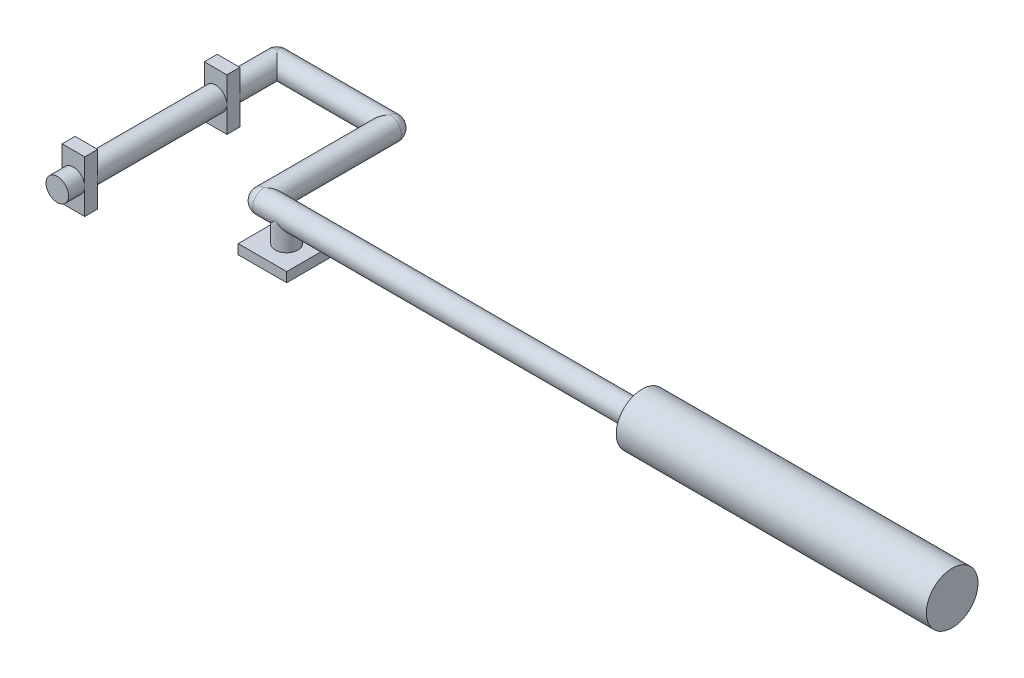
ISO-10303-21;
HEADER;
FILE_DESCRIPTION(('STEP AP214'),'2;1');
FILE_NAME('part.step','',(''),(''),'','','');
FILE_SCHEMA(('AUTOMOTIVE_DESIGN { 1 0 10303 214 1 1 1 1 }'));
ENDSEC;
DATA;
#1=APPLICATION_CONTEXT('core data for automotive mechanical design processes');
#2=APPLICATION_PROTOCOL_DEFINITION('international standard','automotive_design',2000,#1);
#3=PRODUCT_CONTEXT('',#1,'mechanical');
#4=PRODUCT('Part','Part','',(#3));
#5=PRODUCT_RELATED_PRODUCT_CATEGORY('part','',(#4));
#6=PRODUCT_DEFINITION_FORMATION('','',#4);
#7=PRODUCT_DEFINITION_CONTEXT('part definition',#1,'design');
#8=PRODUCT_DEFINITION('design','',#6,#7);
#9=PRODUCT_DEFINITION_SHAPE('','',#8);
#10=(LENGTH_UNIT() NAMED_UNIT(*) SI_UNIT(.MILLI.,.METRE.));
#11=(NAMED_UNIT(*) PLANE_ANGLE_UNIT() SI_UNIT($,.RADIAN.));
#12=(NAMED_UNIT(*) SI_UNIT($,.STERADIAN.) SOLID_ANGLE_UNIT());
#13=UNCERTAINTY_MEASURE_WITH_UNIT(LENGTH_MEASURE(1.E-05),#10,'distance_accuracy_value','');
#14=(GEOMETRIC_REPRESENTATION_CONTEXT(3) GLOBAL_UNCERTAINTY_ASSIGNED_CONTEXT((#13)) GLOBAL_UNIT_ASSIGNED_CONTEXT((#10,
#11,#12)) REPRESENTATION_CONTEXT('',''));
#15=CARTESIAN_POINT('',(0.,0.,0.));
#16=DIRECTION('',(0.,0.,1.));
#17=DIRECTION('',(1.,0.,0.));
#18=AXIS2_PLACEMENT_3D('',#15,#16,#17);
#19=CARTESIAN_POINT('',(23.572307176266,0.,0.));
#20=DIRECTION('',(-1.,0.,0.));
#21=DIRECTION('',(0.,0.,1.));
#22=AXIS2_PLACEMENT_3D('',#19,#20,#21);
#23=CYLINDRICAL_SURFACE('',#22,3.5);
#24=CARTESIAN_POINT('',(35.,0.,0.));
#25=DIRECTION('',(-0.707106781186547,0.,-0.707106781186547));
#26=DIRECTION('',(0.707106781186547,0.,-0.707106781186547));
#27=AXIS2_PLACEMENT_3D('',#24,#25,#26);
#28=ELLIPSE('',#27,4.94974746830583,3.5);
#29=CARTESIAN_POINT('',(35.,3.5,0.));
#30=VERTEX_POINT('',#29);
#31=CARTESIAN_POINT('',(35.,-3.5,0.));
#32=VERTEX_POINT('',#31);
#33=EDGE_CURVE('E222',#30,#32,#28,.T.);
#34=ORIENTED_EDGE('',*,*,#33,.F.);
#35=CARTESIAN_POINT('',(35.,0.,0.));
#36=DIRECTION('',(-1.,0.,0.));
#37=DIRECTION('',(0.,0.,1.));
#38=AXIS2_PLACEMENT_3D('',#35,#36,#37);
#39=CIRCLE('',#38,3.5);
#40=EDGE_CURVE('E219',#32,#30,#39,.T.);
#41=ORIENTED_EDGE('',*,*,#40,.F.);
#42=EDGE_LOOP('',(#34,#41));
#43=FACE_BOUND('',#42,.T.);
#44=CARTESIAN_POINT('',(42.,0.,0.));
#45=DIRECTION('',(-0.707106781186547,-0.707106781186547,0.));
#46=DIRECTION('',(-0.707106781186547,0.707106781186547,0.));
#47=AXIS2_PLACEMENT_3D('',#44,#45,#46);
#48=ELLIPSE('',#47,4.94974746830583,3.5);
#49=CARTESIAN_POINT('',(42.,0.,3.5));
#50=VERTEX_POINT('',#49);
#51=CARTESIAN_POINT('',(42.,0.,-3.5));
#52=VERTEX_POINT('',#51);
#53=EDGE_CURVE('E332',#50,#52,#48,.F.);
#54=ORIENTED_EDGE('',*,*,#53,.T.);
#55=CARTESIAN_POINT('',(42.,0.,0.));
#56=DIRECTION('',(-0.707106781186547,0.707106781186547,0.));
#57=DIRECTION('',(-0.707106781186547,-0.707106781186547,0.));
#58=AXIS2_PLACEMENT_3D('',#55,#56,#57);
#59=ELLIPSE('',#58,4.94974746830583,3.5);
#60=EDGE_CURVE('E40',#52,#50,#59,.T.);
#61=ORIENTED_EDGE('',*,*,#60,.T.);
#62=EDGE_LOOP('',(#54,#61));
#63=FACE_BOUND('',#62,.T.);
#64=CARTESIAN_POINT('',(152.,0.,0.));
#65=DIRECTION('',(1.,0.,0.));
#66=DIRECTION('',(0.,0.,-1.));
#67=AXIS2_PLACEMENT_3D('',#64,#65,#66);
#68=CIRCLE('',#67,3.5);
#69=CARTESIAN_POINT('',(152.,0.,-3.5));
#70=VERTEX_POINT('',#69);
#71=EDGE_CURVE('E11',#70,#70,#68,.T.);
#72=ORIENTED_EDGE('',*,*,#71,.F.);
#73=EDGE_LOOP('',(#72));
#74=FACE_BOUND('',#73,.T.);
#75=ADVANCED_FACE('F32',(#43,#63,#74),#23,.T.);
#76=CARTESIAN_POINT('',(35.,0.,-42.5));
#77=DIRECTION('',(0.,0.,-1.));
#78=DIRECTION('',(-1.,0.,0.));
#79=AXIS2_PLACEMENT_3D('',#76,#77,#78);
#80=CYLINDRICAL_SURFACE('',#79,3.5);
#81=CARTESIAN_POINT('',(35.,0.,-39.));
#82=DIRECTION('',(-0.707106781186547,0.,-0.707106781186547));
#83=DIRECTION('',(-0.707106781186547,0.,0.707106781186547));
#84=AXIS2_PLACEMENT_3D('',#81,#82,#83);
#85=ELLIPSE('',#84,4.94974746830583,3.5);
#86=CARTESIAN_POINT('',(35.,-3.5,-39.));
#87=VERTEX_POINT('',#86);
#88=CARTESIAN_POINT('',(35.,3.5,-39.));
#89=VERTEX_POINT('',#88);
#90=EDGE_CURVE('E230',#87,#89,#85,.T.);
#91=ORIENTED_EDGE('',*,*,#90,.F.);
#92=CARTESIAN_POINT('',(35.,0.,-39.));
#93=DIRECTION('',(0.,0.,-1.));
#94=DIRECTION('',(-1.,0.,0.));
#95=AXIS2_PLACEMENT_3D('',#92,#93,#94);
#96=CIRCLE('',#95,3.5);
#97=EDGE_CURVE('E225',#89,#87,#96,.T.);
#98=ORIENTED_EDGE('',*,*,#97,.F.);
#99=EDGE_LOOP('',(#91,#98));
#100=FACE_BOUND('',#99,.T.);
#101=CARTESIAN_POINT('',(35.,0.,0.));
#102=DIRECTION('',(0.,0.,-1.));
#103=DIRECTION('',(-1.,0.,0.));
#104=AXIS2_PLACEMENT_3D('',#101,#102,#103);
#105=CIRCLE('',#104,3.5);
#106=EDGE_CURVE('E228',#32,#30,#105,.T.);
#107=ORIENTED_EDGE('',*,*,#106,.T.);
#108=ORIENTED_EDGE('',*,*,#33,.T.);
#109=EDGE_LOOP('',(#107,#108));
#110=FACE_BOUND('',#109,.T.);
#111=ADVANCED_FACE('F350',(#100,#110),#80,.T.);
#112=CARTESIAN_POINT('',(0.,0.,-39.));
#113=DIRECTION('',(0.,0.,1.));
#114=DIRECTION('',(1.,0.,0.));
#115=AXIS2_PLACEMENT_3D('',#112,#113,#114);
#116=CYLINDRICAL_SURFACE('',#115,3.5);
#117=CARTESIAN_POINT('',(0.,0.,-24.));
#118=DIRECTION('',(0.,0.,-1.));
#119=DIRECTION('',(-1.,0.,0.));
#120=AXIS2_PLACEMENT_3D('',#117,#118,#119);
#121=CIRCLE('',#120,3.5);
#122=CARTESIAN_POINT('',(-3.5,0.,-24.));
#123=VERTEX_POINT('',#122);
#124=CARTESIAN_POINT('',(3.5,0.,-24.));
#125=VERTEX_POINT('',#124);
#126=EDGE_CURVE('E241',#123,#125,#121,.T.);
#127=ORIENTED_EDGE('',*,*,#126,.T.);
#128=EDGE_CURVE('E53',#125,#123,#121,.T.);
#129=ORIENTED_EDGE('',*,*,#128,.T.);
#130=EDGE_LOOP('',(#127,#129));
#131=FACE_BOUND('',#130,.T.);
#132=CARTESIAN_POINT('',(0.,0.,-39.));
#133=DIRECTION('',(-0.707106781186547,0.,0.707106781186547));
#134=DIRECTION('',(0.707106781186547,0.,0.707106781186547));
#135=AXIS2_PLACEMENT_3D('',#132,#133,#134);
#136=ELLIPSE('',#135,4.94974746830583,3.5);
#137=CARTESIAN_POINT('',(0.,3.5,-39.));
#138=VERTEX_POINT('',#137);
#139=CARTESIAN_POINT('',(0.,-3.5,-39.));
#140=VERTEX_POINT('',#139);
#141=EDGE_CURVE('E238',#138,#140,#136,.F.);
#142=ORIENTED_EDGE('',*,*,#141,.F.);
#143=CARTESIAN_POINT('',(0.,0.,-39.));
#144=DIRECTION('',(0.,0.,-1.));
#145=DIRECTION('',(-1.,0.,0.));
#146=AXIS2_PLACEMENT_3D('',#143,#144,#145);
#147=CIRCLE('',#146,3.5);
#148=EDGE_CURVE('E244',#140,#138,#147,.T.);
#149=ORIENTED_EDGE('',*,*,#148,.F.);
#150=EDGE_LOOP('',(#142,#149));
#151=FACE_BOUND('',#150,.T.);
#152=ADVANCED_FACE('F356',(#131,#151),#116,.T.);
#153=CARTESIAN_POINT('',(-3.5,-8.,-24.));
#154=DIRECTION('',(0.,0.,-1.));
#155=DIRECTION('',(1.,0.,0.));
#156=AXIS2_PLACEMENT_3D('',#153,#154,#155);
#157=PLANE('',#156);
#158=ORIENTED_EDGE('',*,*,#126,.F.);
#159=DIRECTION('',(0.,-1.,0.));
#160=VECTOR('',#159,1.);
#161=CARTESIAN_POINT('',(-3.5,8.,-24.));
#162=LINE('',#161,#160);
#163=CARTESIAN_POINT('',(-3.5,8.,-24.));
#164=VERTEX_POINT('',#163);
#165=EDGE_CURVE('E260',#164,#123,#162,.T.);
#166=ORIENTED_EDGE('',*,*,#165,.F.);
#167=DIRECTION('',(-1.,0.,0.));
#168=VECTOR('',#167,1.);
#169=CARTESIAN_POINT('',(-3.5,8.,-24.));
#170=LINE('',#169,#168);
#171=CARTESIAN_POINT('',(3.5,8.,-24.));
#172=VERTEX_POINT('',#171);
#173=EDGE_CURVE('E262',#172,#164,#170,.T.);
#174=ORIENTED_EDGE('',*,*,#173,.F.);
#175=DIRECTION('',(0.,1.,0.));
#176=VECTOR('',#175,1.);
#177=CARTESIAN_POINT('',(3.5,8.,-24.));
#178=LINE('',#177,#176);
#179=EDGE_CURVE('E265',#125,#172,#178,.T.);
#180=ORIENTED_EDGE('',*,*,#179,.F.);
#181=EDGE_LOOP('',(#158,#166,#174,#180));
#182=FACE_BOUND('',#181,.T.);
#183=ADVANCED_FACE('F371',(#182),#157,.T.);
#184=CARTESIAN_POINT('',(-3.5,-8.,24.));
#185=DIRECTION('',(0.,0.,1.));
#186=DIRECTION('',(1.,0.,0.));
#187=AXIS2_PLACEMENT_3D('',#184,#185,#186);
#188=PLANE('',#187);
#189=CARTESIAN_POINT('',(0.,0.,24.));
#190=DIRECTION('',(0.,0.,1.));
#191=DIRECTION('',(1.,0.,0.));
#192=AXIS2_PLACEMENT_3D('',#189,#190,#191);
#193=CIRCLE('',#192,3.5);
#194=CARTESIAN_POINT('',(3.5,0.,24.));
#195=VERTEX_POINT('',#194);
#196=CARTESIAN_POINT('',(-3.5,0.,24.));
#197=VERTEX_POINT('',#196);
#198=EDGE_CURVE('E282',#195,#197,#193,.T.);
#199=ORIENTED_EDGE('',*,*,#198,.F.);
#200=DIRECTION('',(0.,1.,0.));
#201=VECTOR('',#200,1.);
#202=CARTESIAN_POINT('',(3.5,8.,24.));
#203=LINE('',#202,#201);
#204=CARTESIAN_POINT('',(3.5,8.,24.));
#205=VERTEX_POINT('',#204);
#206=EDGE_CURVE('E307',#195,#205,#203,.T.);
#207=ORIENTED_EDGE('',*,*,#206,.T.);
#208=DIRECTION('',(-1.,0.,0.));
#209=VECTOR('',#208,1.);
#210=CARTESIAN_POINT('',(-3.5,8.,24.));
#211=LINE('',#210,#209);
#212=CARTESIAN_POINT('',(-3.5,8.,24.));
#213=VERTEX_POINT('',#212);
#214=EDGE_CURVE('E310',#205,#213,#211,.T.);
#215=ORIENTED_EDGE('',*,*,#214,.T.);
#216=DIRECTION('',(0.,-1.,0.));
#217=VECTOR('',#216,1.);
#218=CARTESIAN_POINT('',(-3.5,8.,24.));
#219=LINE('',#218,#217);
#220=EDGE_CURVE('E302',#213,#197,#219,.T.);
#221=ORIENTED_EDGE('',*,*,#220,.T.);
#222=EDGE_LOOP('',(#199,#207,#215,#221));
#223=FACE_BOUND('',#222,.T.);
#224=ADVANCED_FACE('F414',(#223),#188,.T.);
#225=CARTESIAN_POINT('',(0.,0.,20.));
#226=DIRECTION('',(0.,0.,-1.));
#227=DIRECTION('',(-1.,0.,0.));
#228=AXIS2_PLACEMENT_3D('',#225,#226,#227);
#229=CYLINDRICAL_SURFACE('',#228,3.5);
#230=CARTESIAN_POINT('',(0.,0.,20.));
#231=DIRECTION('',(0.,0.,1.));
#232=DIRECTION('',(1.,0.,0.));
#233=AXIS2_PLACEMENT_3D('',#230,#231,#232);
#234=CIRCLE('',#233,3.5);
#235=CARTESIAN_POINT('',(3.5,0.,20.));
#236=VERTEX_POINT('',#235);
#237=CARTESIAN_POINT('',(-3.5,0.,20.));
#238=VERTEX_POINT('',#237);
#239=EDGE_CURVE('E329',#236,#238,#234,.T.);
#240=ORIENTED_EDGE('',*,*,#239,.F.);
#241=EDGE_CURVE('E328',#238,#236,#234,.T.);
#242=ORIENTED_EDGE('',*,*,#241,.F.);
#243=EDGE_LOOP('',(#240,#242));
#244=FACE_BOUND('',#243,.T.);
#245=CARTESIAN_POINT('',(0.,0.,-20.));
#246=DIRECTION('',(0.,0.,1.));
#247=DIRECTION('',(1.,0.,0.));
#248=AXIS2_PLACEMENT_3D('',#245,#246,#247);
#249=CIRCLE('',#248,3.5);
#250=CARTESIAN_POINT('',(3.5,0.,-20.));
#251=VERTEX_POINT('',#250);
#252=CARTESIAN_POINT('',(-3.5,0.,-20.));
#253=VERTEX_POINT('',#252);
#254=EDGE_CURVE('E325',#251,#253,#249,.T.);
#255=ORIENTED_EDGE('',*,*,#254,.T.);
#256=EDGE_CURVE('E324',#253,#251,#249,.T.);
#257=ORIENTED_EDGE('',*,*,#256,.T.);
#258=EDGE_LOOP('',(#255,#257));
#259=FACE_BOUND('',#258,.T.);
#260=ADVANCED_FACE('F34',(#244,#259),#229,.T.);
#261=CARTESIAN_POINT('',(-3.5,-8.,20.));
#262=DIRECTION('',(0.,0.,1.));
#263=DIRECTION('',(1.,0.,0.));
#264=AXIS2_PLACEMENT_3D('',#261,#262,#263);
#265=PLANE('',#264);
#266=DIRECTION('',(0.,1.,0.));
#267=VECTOR('',#266,1.);
#268=CARTESIAN_POINT('',(3.5,8.,20.));
#269=LINE('',#268,#267);
#270=CARTESIAN_POINT('',(3.5,8.,20.));
#271=VERTEX_POINT('',#270);
#272=EDGE_CURVE('E295',#236,#271,#269,.T.);
#273=ORIENTED_EDGE('',*,*,#272,.F.);
#274=ORIENTED_EDGE('',*,*,#239,.T.);
#275=DIRECTION('',(0.,-1.,0.));
#276=VECTOR('',#275,1.);
#277=CARTESIAN_POINT('',(-3.5,8.,20.));
#278=LINE('',#277,#276);
#279=CARTESIAN_POINT('',(-3.5,8.,20.));
#280=VERTEX_POINT('',#279);
#281=EDGE_CURVE('E290',#280,#238,#278,.T.);
#282=ORIENTED_EDGE('',*,*,#281,.F.);
#283=DIRECTION('',(-1.,0.,0.));
#284=VECTOR('',#283,1.);
#285=CARTESIAN_POINT('',(-3.5,8.,20.));
#286=LINE('',#285,#284);
#287=EDGE_CURVE('E299',#271,#280,#286,.T.);
#288=ORIENTED_EDGE('',*,*,#287,.F.);
#289=EDGE_LOOP('',(#273,#274,#282,#288));
#290=FACE_BOUND('',#289,.T.);
#291=ADVANCED_FACE('F405',(#290),#265,.F.);
#292=CARTESIAN_POINT('',(-3.5,-8.,20.));
#293=VERTEX_POINT('',#292);
#294=EDGE_CURVE('E289',#238,#293,#278,.T.);
#295=ORIENTED_EDGE('',*,*,#294,.F.);
#296=ORIENTED_EDGE('',*,*,#241,.T.);
#297=CARTESIAN_POINT('',(3.5,-8.,20.));
#298=VERTEX_POINT('',#297);
#299=EDGE_CURVE('E296',#298,#236,#269,.T.);
#300=ORIENTED_EDGE('',*,*,#299,.F.);
#301=DIRECTION('',(1.,0.,0.));
#302=VECTOR('',#301,1.);
#303=CARTESIAN_POINT('',(-3.5,-8.,20.));
#304=LINE('',#303,#302);
#305=EDGE_CURVE('E293',#293,#298,#304,.T.);
#306=ORIENTED_EDGE('',*,*,#305,.F.);
#307=EDGE_LOOP('',(#295,#296,#300,#306));
#308=FACE_BOUND('',#307,.T.);
#309=ADVANCED_FACE('F408',(#308),#265,.F.);
#310=CARTESIAN_POINT('',(-3.5,8.,24.));
#311=DIRECTION('',(1.,0.,0.));
#312=DIRECTION('',(0.,1.,0.));
#313=AXIS2_PLACEMENT_3D('',#310,#311,#312);
#314=PLANE('',#313);
#315=ORIENTED_EDGE('',*,*,#281,.T.);
#316=ORIENTED_EDGE('',*,*,#294,.T.);
#317=DIRECTION('',(0.,0.,-1.));
#318=VECTOR('',#317,1.);
#319=CARTESIAN_POINT('',(-3.5,-8.,24.));
#320=LINE('',#319,#318);
#321=CARTESIAN_POINT('',(-3.5,-8.,24.));
#322=VERTEX_POINT('',#321);
#323=EDGE_CURVE('E321',#322,#293,#320,.T.);
#324=ORIENTED_EDGE('',*,*,#323,.F.);
#325=EDGE_CURVE('E301',#197,#322,#219,.T.);
#326=ORIENTED_EDGE('',*,*,#325,.F.);
#327=ORIENTED_EDGE('',*,*,#220,.F.);
#328=DIRECTION('',(0.,0.,-1.));
#329=VECTOR('',#328,1.);
#330=CARTESIAN_POINT('',(-3.5,8.,24.));
#331=LINE('',#330,#329);
#332=EDGE_CURVE('E312',#213,#280,#331,.T.);
#333=ORIENTED_EDGE('',*,*,#332,.T.);
#334=EDGE_LOOP('',(#315,#316,#324,#326,#327,#333));
#335=FACE_BOUND('',#334,.T.);
#336=ADVANCED_FACE('F424',(#335),#314,.F.);
#337=CARTESIAN_POINT('',(-3.5,-8.,24.));
#338=DIRECTION('',(0.,1.,0.));
#339=DIRECTION('',(0.,0.,1.));
#340=AXIS2_PLACEMENT_3D('',#337,#338,#339);
#341=PLANE('',#340);
#342=ORIENTED_EDGE('',*,*,#305,.T.);
#343=DIRECTION('',(0.,0.,-1.));
#344=VECTOR('',#343,1.);
#345=CARTESIAN_POINT('',(3.5,-8.,24.));
#346=LINE('',#345,#344);
#347=CARTESIAN_POINT('',(3.5,-8.,24.));
#348=VERTEX_POINT('',#347);
#349=EDGE_CURVE('E318',#348,#298,#346,.T.);
#350=ORIENTED_EDGE('',*,*,#349,.F.);
#351=DIRECTION('',(1.,0.,0.));
#352=VECTOR('',#351,1.);
#353=CARTESIAN_POINT('',(-3.5,-8.,24.));
#354=LINE('',#353,#352);
#355=EDGE_CURVE('E305',#322,#348,#354,.T.);
#356=ORIENTED_EDGE('',*,*,#355,.F.);
#357=ORIENTED_EDGE('',*,*,#323,.T.);
#358=EDGE_LOOP('',(#342,#350,#356,#357));
#359=FACE_BOUND('',#358,.T.);
#360=ADVANCED_FACE('F421',(#359),#341,.F.);
#361=CARTESIAN_POINT('',(3.5,8.,24.));
#362=DIRECTION('',(-1.,0.,0.));
#363=DIRECTION('',(0.,-1.,0.));
#364=AXIS2_PLACEMENT_3D('',#361,#362,#363);
#365=PLANE('',#364);
#366=ORIENTED_EDGE('',*,*,#299,.T.);
#367=ORIENTED_EDGE('',*,*,#272,.T.);
#368=DIRECTION('',(0.,0.,-1.));
#369=VECTOR('',#368,1.);
#370=CARTESIAN_POINT('',(3.5,8.,24.));
#371=LINE('',#370,#369);
#372=EDGE_CURVE('E315',#205,#271,#371,.T.);
#373=ORIENTED_EDGE('',*,*,#372,.F.);
#374=ORIENTED_EDGE('',*,*,#206,.F.);
#375=EDGE_CURVE('E308',#348,#195,#203,.T.);
#376=ORIENTED_EDGE('',*,*,#375,.F.);
#377=ORIENTED_EDGE('',*,*,#349,.T.);
#378=EDGE_LOOP('',(#366,#367,#373,#374,#376,#377));
#379=FACE_BOUND('',#378,.T.);
#380=ADVANCED_FACE('F417',(#379),#365,.F.);
#381=CARTESIAN_POINT('',(-3.5,8.,24.));
#382=DIRECTION('',(0.,-1.,0.));
#383=DIRECTION('',(0.,0.,-1.));
#384=AXIS2_PLACEMENT_3D('',#381,#382,#383);
#385=PLANE('',#384);
#386=ORIENTED_EDGE('',*,*,#287,.T.);
#387=ORIENTED_EDGE('',*,*,#332,.F.);
#388=ORIENTED_EDGE('',*,*,#214,.F.);
#389=ORIENTED_EDGE('',*,*,#372,.T.);
#390=EDGE_LOOP('',(#386,#387,#388,#389));
#391=FACE_BOUND('',#390,.T.);
#392=ADVANCED_FACE('F412',(#391),#385,.F.);
#393=EDGE_CURVE('E286',#197,#195,#193,.T.);
#394=ORIENTED_EDGE('',*,*,#393,.F.);
#395=ORIENTED_EDGE('',*,*,#325,.T.);
#396=ORIENTED_EDGE('',*,*,#355,.T.);
#397=ORIENTED_EDGE('',*,*,#375,.T.);
#398=EDGE_LOOP('',(#394,#395,#396,#397));
#399=FACE_BOUND('',#398,.T.);
#400=ADVANCED_FACE('F403',(#399),#188,.T.);
#401=CARTESIAN_POINT('',(0.,0.,29.));
#402=DIRECTION('',(0.,0.,-1.));
#403=DIRECTION('',(-1.,0.,0.));
#404=AXIS2_PLACEMENT_3D('',#401,#402,#403);
#405=CYLINDRICAL_SURFACE('',#404,3.5);
#406=ORIENTED_EDGE('',*,*,#198,.T.);
#407=ORIENTED_EDGE('',*,*,#393,.T.);
#408=EDGE_LOOP('',(#406,#407));
#409=FACE_BOUND('',#408,.T.);
#410=CARTESIAN_POINT('',(0.,0.,29.));
#411=DIRECTION('',(0.,0.,1.));
#412=DIRECTION('',(1.,0.,0.));
#413=AXIS2_PLACEMENT_3D('',#410,#411,#412);
#414=CIRCLE('',#413,3.5);
#415=CARTESIAN_POINT('',(3.5,0.,29.));
#416=VERTEX_POINT('',#415);
#417=EDGE_CURVE('E285',#416,#416,#414,.T.);
#418=ORIENTED_EDGE('',*,*,#417,.F.);
#419=EDGE_LOOP('',(#418));
#420=FACE_BOUND('',#419,.T.);
#421=ADVANCED_FACE('F399',(#409,#420),#405,.T.);
#422=CARTESIAN_POINT('',(0.,0.,29.));
#423=DIRECTION('',(0.,0.,1.));
#424=DIRECTION('',(1.,0.,0.));
#425=AXIS2_PLACEMENT_3D('',#422,#423,#424);
#426=PLANE('',#425);
#427=ORIENTED_EDGE('',*,*,#417,.T.);
#428=EDGE_LOOP('',(#427));
#429=FACE_BOUND('',#428,.T.);
#430=ADVANCED_FACE('F396',(#429),#426,.T.);
#431=CARTESIAN_POINT('',(-3.5,-8.,-20.));
#432=DIRECTION('',(0.,0.,-1.));
#433=DIRECTION('',(1.,0.,0.));
#434=AXIS2_PLACEMENT_3D('',#431,#432,#433);
#435=PLANE('',#434);
#436=ORIENTED_EDGE('',*,*,#254,.F.);
#437=DIRECTION('',(0.,1.,0.));
#438=VECTOR('',#437,1.);
#439=CARTESIAN_POINT('',(3.5,8.,-20.));
#440=LINE('',#439,#438);
#441=CARTESIAN_POINT('',(3.5,8.,-20.));
#442=VERTEX_POINT('',#441);
#443=EDGE_CURVE('E253',#251,#442,#440,.T.);
#444=ORIENTED_EDGE('',*,*,#443,.T.);
#445=DIRECTION('',(-1.,0.,0.));
#446=VECTOR('',#445,1.);
#447=CARTESIAN_POINT('',(-3.5,8.,-20.));
#448=LINE('',#447,#446);
#449=CARTESIAN_POINT('',(-3.5,8.,-20.));
#450=VERTEX_POINT('',#449);
#451=EDGE_CURVE('E250',#442,#450,#448,.T.);
#452=ORIENTED_EDGE('',*,*,#451,.T.);
#453=DIRECTION('',(0.,-1.,0.));
#454=VECTOR('',#453,1.);
#455=CARTESIAN_POINT('',(-3.5,8.,-20.));
#456=LINE('',#455,#454);
#457=EDGE_CURVE('E247',#450,#253,#456,.T.);
#458=ORIENTED_EDGE('',*,*,#457,.T.);
#459=EDGE_LOOP('',(#436,#444,#452,#458));
#460=FACE_BOUND('',#459,.T.);
#461=ADVANCED_FACE('F377',(#460),#435,.F.);
#462=CARTESIAN_POINT('',(-3.5,8.,-24.));
#463=DIRECTION('',(-1.,0.,0.));
#464=DIRECTION('',(0.,-1.,0.));
#465=AXIS2_PLACEMENT_3D('',#462,#463,#464);
#466=PLANE('',#465);
#467=ORIENTED_EDGE('',*,*,#457,.F.);
#468=DIRECTION('',(0.,0.,1.));
#469=VECTOR('',#468,1.);
#470=CARTESIAN_POINT('',(-3.5,8.,-24.));
#471=LINE('',#470,#469);
#472=EDGE_CURVE('E280',#164,#450,#471,.T.);
#473=ORIENTED_EDGE('',*,*,#472,.F.);
#474=ORIENTED_EDGE('',*,*,#165,.T.);
#475=CARTESIAN_POINT('',(-3.5,-8.,-24.));
#476=VERTEX_POINT('',#475);
#477=EDGE_CURVE('E259',#123,#476,#162,.T.);
#478=ORIENTED_EDGE('',*,*,#477,.T.);
#479=DIRECTION('',(0.,0.,1.));
#480=VECTOR('',#479,1.);
#481=CARTESIAN_POINT('',(-3.5,-8.,-24.));
#482=LINE('',#481,#480);
#483=CARTESIAN_POINT('',(-3.5,-8.,-20.));
#484=VERTEX_POINT('',#483);
#485=EDGE_CURVE('E272',#476,#484,#482,.T.);
#486=ORIENTED_EDGE('',*,*,#485,.T.);
#487=EDGE_CURVE('E246',#253,#484,#456,.T.);
#488=ORIENTED_EDGE('',*,*,#487,.F.);
#489=EDGE_LOOP('',(#467,#473,#474,#478,#486,#488));
#490=FACE_BOUND('',#489,.T.);
#491=ADVANCED_FACE('F391',(#490),#466,.T.);
#492=CARTESIAN_POINT('',(-3.5,8.,-24.));
#493=DIRECTION('',(0.,1.,0.));
#494=DIRECTION('',(0.,0.,1.));
#495=AXIS2_PLACEMENT_3D('',#492,#493,#494);
#496=PLANE('',#495);
#497=ORIENTED_EDGE('',*,*,#451,.F.);
#498=DIRECTION('',(0.,0.,1.));
#499=VECTOR('',#498,1.);
#500=CARTESIAN_POINT('',(3.5,8.,-24.));
#501=LINE('',#500,#499);
#502=EDGE_CURVE('E277',#172,#442,#501,.T.);
#503=ORIENTED_EDGE('',*,*,#502,.F.);
#504=ORIENTED_EDGE('',*,*,#173,.T.);
#505=ORIENTED_EDGE('',*,*,#472,.T.);
#506=EDGE_LOOP('',(#497,#503,#504,#505));
#507=FACE_BOUND('',#506,.T.);
#508=ADVANCED_FACE('F387',(#507),#496,.T.);
#509=CARTESIAN_POINT('',(3.5,8.,-24.));
#510=DIRECTION('',(1.,0.,0.));
#511=DIRECTION('',(0.,1.,0.));
#512=AXIS2_PLACEMENT_3D('',#509,#510,#511);
#513=PLANE('',#512);
#514=CARTESIAN_POINT('',(3.5,-8.,-20.));
#515=VERTEX_POINT('',#514);
#516=EDGE_CURVE('E254',#515,#251,#440,.T.);
#517=ORIENTED_EDGE('',*,*,#516,.F.);
#518=DIRECTION('',(0.,0.,1.));
#519=VECTOR('',#518,1.);
#520=CARTESIAN_POINT('',(3.5,-8.,-24.));
#521=LINE('',#520,#519);
#522=CARTESIAN_POINT('',(3.5,-8.,-24.));
#523=VERTEX_POINT('',#522);
#524=EDGE_CURVE('E275',#523,#515,#521,.T.);
#525=ORIENTED_EDGE('',*,*,#524,.F.);
#526=EDGE_CURVE('E266',#523,#125,#178,.T.);
#527=ORIENTED_EDGE('',*,*,#526,.T.);
#528=ORIENTED_EDGE('',*,*,#179,.T.);
#529=ORIENTED_EDGE('',*,*,#502,.T.);
#530=ORIENTED_EDGE('',*,*,#443,.F.);
#531=EDGE_LOOP('',(#517,#525,#527,#528,#529,#530));
#532=FACE_BOUND('',#531,.T.);
#533=ADVANCED_FACE('F383',(#532),#513,.T.);
#534=CARTESIAN_POINT('',(-3.5,-8.,-24.));
#535=DIRECTION('',(0.,-1.,0.));
#536=DIRECTION('',(0.,0.,-1.));
#537=AXIS2_PLACEMENT_3D('',#534,#535,#536);
#538=PLANE('',#537);
#539=DIRECTION('',(1.,0.,0.));
#540=VECTOR('',#539,1.);
#541=CARTESIAN_POINT('',(-3.5,-8.,-20.));
#542=LINE('',#541,#540);
#543=EDGE_CURVE('E256',#484,#515,#542,.T.);
#544=ORIENTED_EDGE('',*,*,#543,.F.);
#545=ORIENTED_EDGE('',*,*,#485,.F.);
#546=DIRECTION('',(1.,0.,0.));
#547=VECTOR('',#546,1.);
#548=CARTESIAN_POINT('',(-3.5,-8.,-24.));
#549=LINE('',#548,#547);
#550=EDGE_CURVE('E269',#476,#523,#549,.T.);
#551=ORIENTED_EDGE('',*,*,#550,.T.);
#552=ORIENTED_EDGE('',*,*,#524,.T.);
#553=EDGE_LOOP('',(#544,#545,#551,#552));
#554=FACE_BOUND('',#553,.T.);
#555=ADVANCED_FACE('F380',(#554),#538,.T.);
#556=ORIENTED_EDGE('',*,*,#128,.F.);
#557=ORIENTED_EDGE('',*,*,#526,.F.);
#558=ORIENTED_EDGE('',*,*,#550,.F.);
#559=ORIENTED_EDGE('',*,*,#477,.F.);
#560=EDGE_LOOP('',(#556,#557,#558,#559));
#561=FACE_BOUND('',#560,.T.);
#562=ADVANCED_FACE('F375',(#561),#157,.T.);
#563=ORIENTED_EDGE('',*,*,#256,.F.);
#564=ORIENTED_EDGE('',*,*,#487,.T.);
#565=ORIENTED_EDGE('',*,*,#543,.T.);
#566=ORIENTED_EDGE('',*,*,#516,.T.);
#567=EDGE_LOOP('',(#563,#564,#565,#566));
#568=FACE_BOUND('',#567,.T.);
#569=ADVANCED_FACE('F367',(#568),#435,.F.);
#570=CARTESIAN_POINT('',(35.,0.,-39.));
#571=DIRECTION('',(-1.,0.,0.));
#572=DIRECTION('',(0.,0.,1.));
#573=AXIS2_PLACEMENT_3D('',#570,#571,#572);
#574=CYLINDRICAL_SURFACE('',#573,3.5);
#575=CARTESIAN_POINT('',(35.,0.,-39.));
#576=DIRECTION('',(1.,0.,0.));
#577=DIRECTION('',(0.,0.,-1.));
#578=AXIS2_PLACEMENT_3D('',#575,#576,#577);
#579=CIRCLE('',#578,3.5);
#580=EDGE_CURVE('E235',#87,#89,#579,.T.);
#581=ORIENTED_EDGE('',*,*,#580,.F.);
#582=ORIENTED_EDGE('',*,*,#90,.T.);
#583=EDGE_LOOP('',(#581,#582));
#584=FACE_BOUND('',#583,.T.);
#585=CARTESIAN_POINT('',(0.,0.,-39.));
#586=DIRECTION('',(1.,0.,0.));
#587=DIRECTION('',(0.,0.,-1.));
#588=AXIS2_PLACEMENT_3D('',#585,#586,#587);
#589=CIRCLE('',#588,3.5);
#590=EDGE_CURVE('E232',#140,#138,#589,.T.);
#591=ORIENTED_EDGE('',*,*,#590,.T.);
#592=ORIENTED_EDGE('',*,*,#141,.T.);
#593=EDGE_LOOP('',(#591,#592));
#594=FACE_BOUND('',#593,.T.);
#595=ADVANCED_FACE('F364',(#584,#594),#574,.T.);
#596=CARTESIAN_POINT('',(0.,0.,-39.));
#597=DIRECTION('',(0.,-1.,0.));
#598=DIRECTION('',(1.,0.,0.));
#599=AXIS2_PLACEMENT_3D('',#596,#597,#598);
#600=SPHERICAL_SURFACE('',#599,3.5);
#601=ORIENTED_EDGE('',*,*,#590,.F.);
#602=ORIENTED_EDGE('',*,*,#148,.T.);
#603=EDGE_LOOP('',(#601,#602));
#604=FACE_BOUND('',#603,.T.);
#605=ADVANCED_FACE('F361',(#604),#600,.T.);
#606=CARTESIAN_POINT('',(35.,0.,-39.));
#607=DIRECTION('',(0.,1.,0.));
#608=DIRECTION('',(0.,0.,-1.));
#609=AXIS2_PLACEMENT_3D('',#606,#607,#608);
#610=SPHERICAL_SURFACE('',#609,3.5);
#611=ORIENTED_EDGE('',*,*,#580,.T.);
#612=ORIENTED_EDGE('',*,*,#97,.T.);
#613=EDGE_LOOP('',(#611,#612));
#614=FACE_BOUND('',#613,.T.);
#615=ADVANCED_FACE('F345',(#614),#610,.T.);
#616=CARTESIAN_POINT('',(35.,0.,0.));
#617=DIRECTION('',(0.,1.,0.));
#618=DIRECTION('',(1.,0.,0.));
#619=AXIS2_PLACEMENT_3D('',#616,#617,#618);
#620=SPHERICAL_SURFACE('',#619,3.5);
#621=ORIENTED_EDGE('',*,*,#40,.T.);
#622=ORIENTED_EDGE('',*,*,#106,.F.);
#623=EDGE_LOOP('',(#621,#622));
#624=FACE_BOUND('',#623,.T.);
#625=ADVANCED_FACE('F337',(#624),#620,.T.);
#626=CARTESIAN_POINT('',(42.,-8.,0.));
#627=DIRECTION('',(0.,1.,0.));
#628=DIRECTION('',(0.,0.,1.));
#629=AXIS2_PLACEMENT_3D('',#626,#627,#628);
#630=CYLINDRICAL_SURFACE('',#629,3.5);
#631=CARTESIAN_POINT('',(42.,-8.,0.));
#632=DIRECTION('',(0.,1.,0.));
#633=DIRECTION('',(0.,0.,1.));
#634=AXIS2_PLACEMENT_3D('',#631,#632,#633);
#635=CIRCLE('',#634,3.5);
#636=CARTESIAN_POINT('',(42.,-8.,3.5));
#637=VERTEX_POINT('',#636);
#638=EDGE_CURVE('E188',#637,#637,#635,.F.);
#639=ORIENTED_EDGE('',*,*,#638,.F.);
#640=EDGE_LOOP('',(#639));
#641=FACE_BOUND('',#640,.T.);
#642=ORIENTED_EDGE('',*,*,#60,.F.);
#643=ORIENTED_EDGE('',*,*,#53,.F.);
#644=EDGE_LOOP('',(#642,#643));
#645=FACE_BOUND('',#644,.T.);
#646=ADVANCED_FACE('F335',(#641,#645),#630,.T.);
#647=CARTESIAN_POINT('',(34.5,-11.,-7.5));
#648=DIRECTION('',(1.,0.,0.));
#649=DIRECTION('',(0.,0.,-1.));
#650=AXIS2_PLACEMENT_3D('',#647,#648,#649);
#651=PLANE('',#650);
#652=DIRECTION('',(0.,0.,-1.));
#653=VECTOR('',#652,1.);
#654=CARTESIAN_POINT('',(34.5,-8.,-7.5));
#655=LINE('',#654,#653);
#656=CARTESIAN_POINT('',(34.5,-8.,7.5));
#657=VERTEX_POINT('',#656);
#658=CARTESIAN_POINT('',(34.5,-8.,-7.5));
#659=VERTEX_POINT('',#658);
#660=EDGE_CURVE('E175',#657,#659,#655,.T.);
#661=ORIENTED_EDGE('',*,*,#660,.T.);
#662=DIRECTION('',(0.,1.,0.));
#663=VECTOR('',#662,1.);
#664=CARTESIAN_POINT('',(34.5,-11.,-7.5));
#665=LINE('',#664,#663);
#666=CARTESIAN_POINT('',(34.5,-11.,-7.5));
#667=VERTEX_POINT('',#666);
#668=EDGE_CURVE('E182',#667,#659,#665,.T.);
#669=ORIENTED_EDGE('',*,*,#668,.F.);
#670=DIRECTION('',(0.,0.,-1.));
#671=VECTOR('',#670,1.);
#672=CARTESIAN_POINT('',(34.5,-11.,-7.5));
#673=LINE('',#672,#671);
#674=CARTESIAN_POINT('',(34.5,-11.,7.5));
#675=VERTEX_POINT('',#674);
#676=EDGE_CURVE('E205',#675,#667,#673,.T.);
#677=ORIENTED_EDGE('',*,*,#676,.F.);
#678=DIRECTION('',(0.,1.,0.));
#679=VECTOR('',#678,1.);
#680=CARTESIAN_POINT('',(34.5,-11.,7.5));
#681=LINE('',#680,#679);
#682=EDGE_CURVE('E194',#675,#657,#681,.T.);
#683=ORIENTED_EDGE('',*,*,#682,.T.);
#684=EDGE_LOOP('',(#661,#669,#677,#683));
#685=FACE_BOUND('',#684,.T.);
#686=ADVANCED_FACE('F192',(#685),#651,.F.);
#687=CARTESIAN_POINT('',(34.5,-11.,-7.5));
#688=DIRECTION('',(0.,0.,1.));
#689=DIRECTION('',(1.,0.,0.));
#690=AXIS2_PLACEMENT_3D('',#687,#688,#689);
#691=PLANE('',#690);
#692=DIRECTION('',(1.,0.,0.));
#693=VECTOR('',#692,1.);
#694=CARTESIAN_POINT('',(34.5,-8.,-7.5));
#695=LINE('',#694,#693);
#696=CARTESIAN_POINT('',(49.5,-8.,-7.5));
#697=VERTEX_POINT('',#696);
#698=EDGE_CURVE('E170',#659,#697,#695,.T.);
#699=ORIENTED_EDGE('',*,*,#698,.T.);
#700=DIRECTION('',(0.,1.,0.));
#701=VECTOR('',#700,1.);
#702=CARTESIAN_POINT('',(49.5,-11.,-7.5));
#703=LINE('',#702,#701);
#704=CARTESIAN_POINT('',(49.5,-11.,-7.5));
#705=VERTEX_POINT('',#704);
#706=EDGE_CURVE('E189',#705,#697,#703,.T.);
#707=ORIENTED_EDGE('',*,*,#706,.F.);
#708=DIRECTION('',(1.,0.,0.));
#709=VECTOR('',#708,1.);
#710=CARTESIAN_POINT('',(34.5,-11.,-7.5));
#711=LINE('',#710,#709);
#712=EDGE_CURVE('E184',#667,#705,#711,.T.);
#713=ORIENTED_EDGE('',*,*,#712,.F.);
#714=ORIENTED_EDGE('',*,*,#668,.T.);
#715=EDGE_LOOP('',(#699,#707,#713,#714));
#716=FACE_BOUND('',#715,.T.);
#717=ADVANCED_FACE('F183',(#716),#691,.F.);
#718=CARTESIAN_POINT('',(49.5,-11.,-7.5));
#719=DIRECTION('',(-1.,0.,0.));
#720=DIRECTION('',(0.,0.,1.));
#721=AXIS2_PLACEMENT_3D('',#718,#719,#720);
#722=PLANE('',#721);
#723=DIRECTION('',(0.,0.,1.));
#724=VECTOR('',#723,1.);
#725=CARTESIAN_POINT('',(49.5,-8.,-7.5));
#726=LINE('',#725,#724);
#727=CARTESIAN_POINT('',(49.5,-8.,7.5));
#728=VERTEX_POINT('',#727);
#729=EDGE_CURVE('E176',#697,#728,#726,.T.);
#730=ORIENTED_EDGE('',*,*,#729,.T.);
#731=DIRECTION('',(0.,1.,0.));
#732=VECTOR('',#731,1.);
#733=CARTESIAN_POINT('',(49.5,-11.,7.5));
#734=LINE('',#733,#732);
#735=CARTESIAN_POINT('',(49.5,-11.,7.5));
#736=VERTEX_POINT('',#735);
#737=EDGE_CURVE('E213',#736,#728,#734,.T.);
#738=ORIENTED_EDGE('',*,*,#737,.F.);
#739=DIRECTION('',(0.,0.,1.));
#740=VECTOR('',#739,1.);
#741=CARTESIAN_POINT('',(49.5,-11.,-7.5));
#742=LINE('',#741,#740);
#743=EDGE_CURVE('E208',#705,#736,#742,.T.);
#744=ORIENTED_EDGE('',*,*,#743,.F.);
#745=ORIENTED_EDGE('',*,*,#706,.T.);
#746=EDGE_LOOP('',(#730,#738,#744,#745));
#747=FACE_BOUND('',#746,.T.);
#748=ADVANCED_FACE('F522',(#747),#722,.F.);
#749=CARTESIAN_POINT('',(34.5,-11.,7.5));
#750=DIRECTION('',(0.,0.,-1.));
#751=DIRECTION('',(-1.,0.,0.));
#752=AXIS2_PLACEMENT_3D('',#749,#750,#751);
#753=PLANE('',#752);
#754=DIRECTION('',(-1.,0.,0.));
#755=VECTOR('',#754,1.);
#756=CARTESIAN_POINT('',(34.5,-8.,7.5));
#757=LINE('',#756,#755);
#758=EDGE_CURVE('E203',#728,#657,#757,.T.);
#759=ORIENTED_EDGE('',*,*,#758,.T.);
#760=ORIENTED_EDGE('',*,*,#682,.F.);
#761=DIRECTION('',(-1.,0.,0.));
#762=VECTOR('',#761,1.);
#763=CARTESIAN_POINT('',(34.5,-11.,7.5));
#764=LINE('',#763,#762);
#765=EDGE_CURVE('E210',#736,#675,#764,.T.);
#766=ORIENTED_EDGE('',*,*,#765,.F.);
#767=ORIENTED_EDGE('',*,*,#737,.T.);
#768=EDGE_LOOP('',(#759,#760,#766,#767));
#769=FACE_BOUND('',#768,.T.);
#770=ADVANCED_FACE('F531',(#769),#753,.F.);
#771=CARTESIAN_POINT('',(34.5,-11.,-7.5));
#772=DIRECTION('',(0.,1.,0.));
#773=DIRECTION('',(0.,0.,1.));
#774=AXIS2_PLACEMENT_3D('',#771,#772,#773);
#775=PLANE('',#774);
#776=ORIENTED_EDGE('',*,*,#676,.T.);
#777=ORIENTED_EDGE('',*,*,#712,.T.);
#778=ORIENTED_EDGE('',*,*,#743,.T.);
#779=ORIENTED_EDGE('',*,*,#765,.T.);
#780=EDGE_LOOP('',(#776,#777,#778,#779));
#781=FACE_BOUND('',#780,.T.);
#782=ADVANCED_FACE('F541',(#781),#775,.F.);
#783=CARTESIAN_POINT('',(34.5,-8.,-7.5));
#784=DIRECTION('',(0.,1.,0.));
#785=DIRECTION('',(0.,0.,1.));
#786=AXIS2_PLACEMENT_3D('',#783,#784,#785);
#787=PLANE('',#786);
#788=ORIENTED_EDGE('',*,*,#638,.T.);
#789=EDGE_LOOP('',(#788));
#790=FACE_BOUND('',#789,.T.);
#791=ORIENTED_EDGE('',*,*,#660,.F.);
#792=ORIENTED_EDGE('',*,*,#758,.F.);
#793=ORIENTED_EDGE('',*,*,#729,.F.);
#794=ORIENTED_EDGE('',*,*,#698,.F.);
#795=EDGE_LOOP('',(#791,#792,#793,#794));
#796=FACE_BOUND('',#795,.T.);
#797=ADVANCED_FACE('F172',(#790,#796),#787,.T.);
#798=CARTESIAN_POINT('',(152.,0.,0.));
#799=DIRECTION('',(1.,0.,0.));
#800=DIRECTION('',(0.,0.,-1.));
#801=AXIS2_PLACEMENT_3D('',#798,#799,#800);
#802=PLANE('',#801);
#803=CARTESIAN_POINT('',(152.,0.,0.));
#804=DIRECTION('',(1.,0.,0.));
#805=DIRECTION('',(0.,0.,-1.));
#806=AXIS2_PLACEMENT_3D('',#803,#804,#805);
#807=CIRCLE('',#806,7.99160357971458);
#808=CARTESIAN_POINT('',(152.,0.,-7.99160357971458));
#809=VERTEX_POINT('',#808);
#810=EDGE_CURVE('E198',#809,#809,#807,.T.);
#811=ORIENTED_EDGE('',*,*,#810,.F.);
#812=EDGE_LOOP('',(#811));
#813=FACE_BOUND('',#812,.T.);
#814=ORIENTED_EDGE('',*,*,#71,.T.);
#815=EDGE_LOOP('',(#814));
#816=FACE_BOUND('',#815,.T.);
#817=ADVANCED_FACE('F559',(#813,#816),#802,.F.);
#818=CARTESIAN_POINT('',(248.,0.,0.));
#819=DIRECTION('',(-1.,0.,0.));
#820=DIRECTION('',(0.,0.,1.));
#821=AXIS2_PLACEMENT_3D('',#818,#819,#820);
#822=CYLINDRICAL_SURFACE('',#821,7.99160357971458);
#823=CARTESIAN_POINT('',(248.,0.,0.));
#824=DIRECTION('',(1.,0.,0.));
#825=DIRECTION('',(0.,0.,-1.));
#826=AXIS2_PLACEMENT_3D('',#823,#824,#825);
#827=CIRCLE('',#826,7.99160357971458);
#828=CARTESIAN_POINT('',(248.,0.,-7.99160357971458));
#829=VERTEX_POINT('',#828);
#830=EDGE_CURVE('E195',#829,#829,#827,.T.);
#831=ORIENTED_EDGE('',*,*,#830,.F.);
#832=EDGE_LOOP('',(#831));
#833=FACE_BOUND('',#832,.T.);
#834=ORIENTED_EDGE('',*,*,#810,.T.);
#835=EDGE_LOOP('',(#834));
#836=FACE_BOUND('',#835,.T.);
#837=ADVANCED_FACE('F574',(#833,#836),#822,.T.);
#838=CARTESIAN_POINT('',(248.,0.,0.));
#839=DIRECTION('',(1.,0.,0.));
#840=DIRECTION('',(0.,0.,-1.));
#841=AXIS2_PLACEMENT_3D('',#838,#839,#840);
#842=PLANE('',#841);
#843=ORIENTED_EDGE('',*,*,#830,.T.);
#844=EDGE_LOOP('',(#843));
#845=FACE_BOUND('',#844,.T.);
#846=ADVANCED_FACE('F584',(#845),#842,.T.);
#847=CLOSED_SHELL('',(#75,#111,#152,#183,#224,#260,#291,#309,#336,#360,#380,#392,#400,#421,#430,
#461,#491,#508,#533,#555,#562,#569,#595,#605,#615,#625,#646,#686,#717,#748,#770,#782,#797,#817,
#837,#846));
#848=MANIFOLD_SOLID_BREP('B2',#847);
#849=ADVANCED_BREP_SHAPE_REPRESENTATION('',(#18,#848),#14);
#850=SHAPE_DEFINITION_REPRESENTATION(#9,#849);
ENDSEC;
END-ISO-10303-21;
